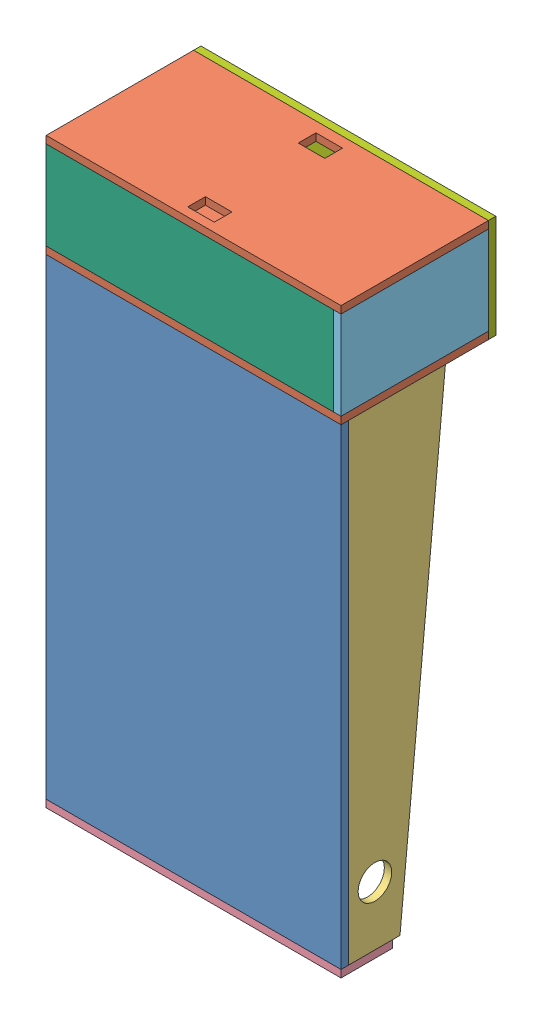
SolidWorks assembly pinball enclosure.SLDASM, configuration Default (file format 12000). Lengths in mm.
Overall size (254 501.65 133.35).
10 component instances, 7 part files, 19 mates.
Components (placement in the parent):
- base-1: base.SLDPRT [Default] at (-22.2042 13.1183 317.2401) size (254 406.4 6.35)
- backboard-1: backboard.SLDPRT [Default] at (-22.2042 425.8683 196.5901) x (1 0 0) z (0 -1 0) size (254 127 6.35)
- side panel-1: side panel.SLDPRT [Default] at (225.4458 419.5183 317.2401) x (0 -1 0) z (1 0 0) size (406.4 83.57 6.35)
- side panel-2: side panel.SLDPRT [Default] at (-22.2042 419.5183 317.2401) x (0 -1 0) z (1 0 0) size (406.4 83.57 6.35)
- front panel-1: front panel.SLDPRT [Default] at (-22.2042 6.7683 323.5901) x (1 0 0) z (0 1 0) size (254 44.45 6.35)
- backboard side panel-1: backboard side panel.SLDPRT [Default] at (225.4458 502.0683 323.5901) x (0 -1 0) z (1 0 0) size (76.2 127 6.35)
- backboard side panel-2: backboard side panel.SLDPRT [Default] at (-22.2042 502.0683 323.5901) x (0 -1 0) z (1 0 0) size (76.2 127 6.35)
- backboard base-1: backboard base.SLDPRT [Default] at (-22.2042 425.8683 317.2401) size (247.65 76.2 6.35)
- backboard-2: backboard.SLDPRT [Default] at (-22.2042 508.4183 196.5901) x (1 0 0) z (0 -1 0) size (254 127 6.35)
- backboard top-1: backboard top.SLDPRT [Default] at (-22.2042 419.5183 190.2401) size (254 88.9 6.35)
Mates (geometry in assembly coordinates):
- Coincident1: coincident anti-aligned: line of base-1 through (231.7958 419.5183 323.5901) axis (-1 0 0); line of backboard-1 through (-22.2042 419.5183 323.5901) axis (1 0 0)
- Coincident2: coincident anti-aligned: plane of base-1 through (-22.2042 419.5183 323.5901) normal (0 1 0); plane of backboard-1 through (-22.2042 419.5183 196.5901) normal (0 -1 0)
- Coincident3: coincident anti-aligned: line of base-1 through (-22.2042 419.5183 323.5901) axis (0 0 -1); line of backboard-1 through (-22.2042 419.5183 196.5901) axis (0 0 1)
- Coincident17: coincident: point of base-1; point of side panel-1
- Coincident18: coincident aligned: line of base-1 through (231.7958 13.1183 323.5901) axis (0 0 -1); line of side panel-1 through (231.7958 13.1183 317.2401) axis (0 0 -1)
- Coincident19: coincident: point of base-1; point of side panel-2
- Coincident20: coincident aligned: line of base-1 through (-22.2042 13.1183 323.5901) axis (0 0 -1); line of side panel-2 through (-22.2042 13.1183 317.2401) axis (0 0 -1)
- Coincident21: coincident: point of base-1; point of front panel-1
- Coincident22: coincident: point of base-1; point of front panel-1
- Coincident23: coincident: line of side panel-2 through (-22.2042 13.1183 317.2401) axis (0 0 -1); point of front panel-1
- Coincident24: coincident: point of base-1; point of front panel-1
- Coincident26: coincident anti-aligned: line of backboard-1 through (231.7958 425.8683 196.5901) axis (0 0 1); line of backboard side panel-1 through (231.7958 425.8683 323.5901) axis (0 0 -1)
- Coincident27: coincident: point of backboard-1; point of backboard side panel-1
- Coincident28: coincident anti-aligned: line of backboard-1 through (231.7958 419.5183 323.5901) axis (0 1 0); line of backboard side panel-1 through (231.7958 502.0683 323.5901) axis (0 -1 0)
- Parallel3: parallel anti-aligned: plane of backboard-1 through (-22.2042 425.8683 196.5901) normal (0 1 0); plane of backboard base-1 through (-22.2042 425.8683 323.5901) normal (0 -1 0)
- Coincident37: coincident: line of backboard side panel-1 through (225.4458 502.0683 196.5901) axis (0 0 1); point of backboard base-1
- Coincident38: coincident: point of backboard-1; point of backboard top-1
- Coincident39: coincident: point of backboard-2; point of backboard top-1
- Coincident44: coincident anti-aligned: line of backboard side panel-1 through (225.4458 502.0683 323.5901) axis (0 -1 0); line of backboard base-1 through (225.4458 425.8683 323.5901) axis (0 1 0)
